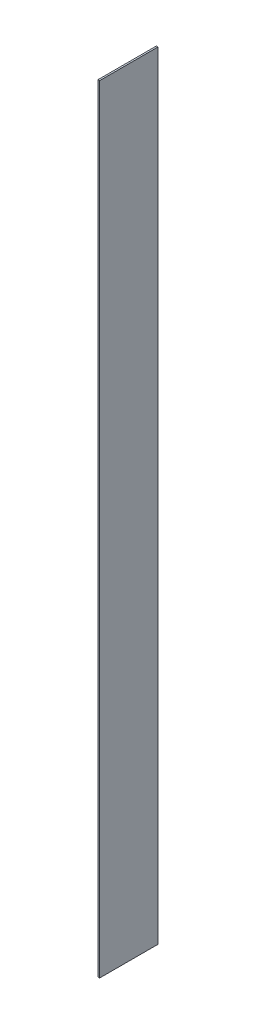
ISO-10303-21;
HEADER;
FILE_DESCRIPTION(('STEP AP214'),'2;1');
FILE_NAME('part.step','',(''),(''),'','','');
FILE_SCHEMA(('AUTOMOTIVE_DESIGN { 1 0 10303 214 1 1 1 1 }'));
ENDSEC;
DATA;
#1=APPLICATION_CONTEXT('core data for automotive mechanical design processes');
#2=APPLICATION_PROTOCOL_DEFINITION('international standard','automotive_design',2000,#1);
#3=PRODUCT_CONTEXT('',#1,'mechanical');
#4=PRODUCT('Part','Part','',(#3));
#5=PRODUCT_RELATED_PRODUCT_CATEGORY('part','',(#4));
#6=PRODUCT_DEFINITION_FORMATION('','',#4);
#7=PRODUCT_DEFINITION_CONTEXT('part definition',#1,'design');
#8=PRODUCT_DEFINITION('design','',#6,#7);
#9=PRODUCT_DEFINITION_SHAPE('','',#8);
#10=(LENGTH_UNIT() NAMED_UNIT(*) SI_UNIT(.MILLI.,.METRE.));
#11=(NAMED_UNIT(*) PLANE_ANGLE_UNIT() SI_UNIT($,.RADIAN.));
#12=(NAMED_UNIT(*) SI_UNIT($,.STERADIAN.) SOLID_ANGLE_UNIT());
#13=UNCERTAINTY_MEASURE_WITH_UNIT(LENGTH_MEASURE(1.E-05),#10,'distance_accuracy_value','');
#14=(GEOMETRIC_REPRESENTATION_CONTEXT(3) GLOBAL_UNCERTAINTY_ASSIGNED_CONTEXT((#13)) GLOBAL_UNIT_ASSIGNED_CONTEXT((#10,
#11,#12)) REPRESENTATION_CONTEXT('',''));
#15=CARTESIAN_POINT('',(0.,0.,0.));
#16=DIRECTION('',(0.,0.,1.));
#17=DIRECTION('',(1.,0.,0.));
#18=AXIS2_PLACEMENT_3D('',#15,#16,#17);
#19=CARTESIAN_POINT('',(-19.0499999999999,8973.4125,673.00625));
#20=DIRECTION('',(1.,0.,0.));
#21=DIRECTION('',(0.,0.,-1.));
#22=AXIS2_PLACEMENT_3D('',#19,#20,#21);
#23=PLANE('',#22);
#24=DIRECTION('',(0.,0.,1.));
#25=VECTOR('',#24,1.);
#26=CARTESIAN_POINT('',(-19.0499999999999,-8973.4125,673.00625));
#27=LINE('',#26,#25);
#28=CARTESIAN_POINT('',(-19.0500000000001,-8973.4125,-673.00625));
#29=VERTEX_POINT('',#28);
#30=CARTESIAN_POINT('',(-19.0499999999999,-8973.4125,673.00625));
#31=VERTEX_POINT('',#30);
#32=EDGE_CURVE('E114',#29,#31,#27,.T.);
#33=ORIENTED_EDGE('',*,*,#32,.T.);
#34=DIRECTION('',(0.,-1.,0.));
#35=VECTOR('',#34,1.);
#36=CARTESIAN_POINT('',(-19.0499999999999,8973.4125,673.00625));
#37=LINE('',#36,#35);
#38=CARTESIAN_POINT('',(-19.0499999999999,8973.4125,673.00625));
#39=VERTEX_POINT('',#38);
#40=EDGE_CURVE('E11',#39,#31,#37,.T.);
#41=ORIENTED_EDGE('',*,*,#40,.F.);
#42=DIRECTION('',(0.,0.,1.));
#43=VECTOR('',#42,1.);
#44=CARTESIAN_POINT('',(-19.0499999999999,8973.4125,673.00625));
#45=LINE('',#44,#43);
#46=CARTESIAN_POINT('',(-19.0500000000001,8973.4125,-673.00625));
#47=VERTEX_POINT('',#46);
#48=EDGE_CURVE('E100',#47,#39,#45,.T.);
#49=ORIENTED_EDGE('',*,*,#48,.F.);
#50=DIRECTION('',(0.,-1.,0.));
#51=VECTOR('',#50,1.);
#52=CARTESIAN_POINT('',(-19.0500000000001,8973.4125,-673.00625));
#53=LINE('',#52,#51);
#54=EDGE_CURVE('E108',#47,#29,#53,.T.);
#55=ORIENTED_EDGE('',*,*,#54,.T.);
#56=EDGE_LOOP('',(#33,#41,#49,#55));
#57=FACE_BOUND('',#56,.T.);
#58=ADVANCED_FACE('F44',(#57),#23,.F.);
#59=CARTESIAN_POINT('',(19.0500000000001,8973.4125,673.00625));
#60=DIRECTION('',(0.,0.,-1.));
#61=DIRECTION('',(-1.,0.,0.));
#62=AXIS2_PLACEMENT_3D('',#59,#60,#61);
#63=PLANE('',#62);
#64=DIRECTION('',(1.,0.,0.));
#65=VECTOR('',#64,1.);
#66=CARTESIAN_POINT('',(19.0500000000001,-8973.4125,673.00625));
#67=LINE('',#66,#65);
#68=CARTESIAN_POINT('',(19.0500000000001,-8973.4125,673.00625));
#69=VERTEX_POINT('',#68);
#70=EDGE_CURVE('E105',#31,#69,#67,.T.);
#71=ORIENTED_EDGE('',*,*,#70,.T.);
#72=DIRECTION('',(0.,-1.,0.));
#73=VECTOR('',#72,1.);
#74=CARTESIAN_POINT('',(19.0500000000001,8973.4125,673.00625));
#75=LINE('',#74,#73);
#76=CARTESIAN_POINT('',(19.0500000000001,8973.4125,673.00625));
#77=VERTEX_POINT('',#76);
#78=EDGE_CURVE('E53',#77,#69,#75,.T.);
#79=ORIENTED_EDGE('',*,*,#78,.F.);
#80=DIRECTION('',(1.,0.,0.));
#81=VECTOR('',#80,1.);
#82=CARTESIAN_POINT('',(19.0500000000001,8973.4125,673.00625));
#83=LINE('',#82,#81);
#84=EDGE_CURVE('E95',#39,#77,#83,.T.);
#85=ORIENTED_EDGE('',*,*,#84,.F.);
#86=ORIENTED_EDGE('',*,*,#40,.T.);
#87=EDGE_LOOP('',(#71,#79,#85,#86));
#88=FACE_BOUND('',#87,.T.);
#89=ADVANCED_FACE('F101',(#88),#63,.F.);
#90=CARTESIAN_POINT('',(19.0500000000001,8973.4125,673.00625));
#91=DIRECTION('',(-1.,0.,0.));
#92=DIRECTION('',(0.,0.,1.));
#93=AXIS2_PLACEMENT_3D('',#90,#91,#92);
#94=PLANE('',#93);
#95=DIRECTION('',(0.,0.,-1.));
#96=VECTOR('',#95,1.);
#97=CARTESIAN_POINT('',(19.0500000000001,-8973.4125,673.00625));
#98=LINE('',#97,#96);
#99=CARTESIAN_POINT('',(19.0499999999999,-8973.4125,-673.00625));
#100=VERTEX_POINT('',#99);
#101=EDGE_CURVE('E79',#69,#100,#98,.T.);
#102=ORIENTED_EDGE('',*,*,#101,.T.);
#103=DIRECTION('',(0.,-1.,0.));
#104=VECTOR('',#103,1.);
#105=CARTESIAN_POINT('',(19.0499999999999,8973.4125,-673.00625));
#106=LINE('',#105,#104);
#107=CARTESIAN_POINT('',(19.0499999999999,8973.4125,-673.00625));
#108=VERTEX_POINT('',#107);
#109=EDGE_CURVE('E102',#108,#100,#106,.T.);
#110=ORIENTED_EDGE('',*,*,#109,.F.);
#111=DIRECTION('',(0.,0.,-1.));
#112=VECTOR('',#111,1.);
#113=CARTESIAN_POINT('',(19.0500000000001,8973.4125,673.00625));
#114=LINE('',#113,#112);
#115=EDGE_CURVE('E92',#77,#108,#114,.T.);
#116=ORIENTED_EDGE('',*,*,#115,.F.);
#117=ORIENTED_EDGE('',*,*,#78,.T.);
#118=EDGE_LOOP('',(#102,#110,#116,#117));
#119=FACE_BOUND('',#118,.T.);
#120=ADVANCED_FACE('F104',(#119),#94,.F.);
#121=CARTESIAN_POINT('',(19.0499999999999,8973.4125,-673.00625));
#122=DIRECTION('',(0.,0.,1.));
#123=DIRECTION('',(1.,0.,0.));
#124=AXIS2_PLACEMENT_3D('',#121,#122,#123);
#125=PLANE('',#124);
#126=DIRECTION('',(-1.,0.,0.));
#127=VECTOR('',#126,1.);
#128=CARTESIAN_POINT('',(19.0499999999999,-8973.4125,-673.00625));
#129=LINE('',#128,#127);
#130=EDGE_CURVE('E81',#100,#29,#129,.T.);
#131=ORIENTED_EDGE('',*,*,#130,.T.);
#132=ORIENTED_EDGE('',*,*,#54,.F.);
#133=DIRECTION('',(-1.,0.,0.));
#134=VECTOR('',#133,1.);
#135=CARTESIAN_POINT('',(19.0499999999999,8973.4125,-673.00625));
#136=LINE('',#135,#134);
#137=EDGE_CURVE('E65',#108,#47,#136,.T.);
#138=ORIENTED_EDGE('',*,*,#137,.F.);
#139=ORIENTED_EDGE('',*,*,#109,.T.);
#140=EDGE_LOOP('',(#131,#132,#138,#139));
#141=FACE_BOUND('',#140,.T.);
#142=ADVANCED_FACE('F127',(#141),#125,.F.);
#143=CARTESIAN_POINT('',(0.,8973.4125,0.));
#144=DIRECTION('',(0.,1.,0.));
#145=DIRECTION('',(0.,0.,1.));
#146=AXIS2_PLACEMENT_3D('',#143,#144,#145);
#147=PLANE('',#146);
#148=ORIENTED_EDGE('',*,*,#48,.T.);
#149=ORIENTED_EDGE('',*,*,#84,.T.);
#150=ORIENTED_EDGE('',*,*,#115,.T.);
#151=ORIENTED_EDGE('',*,*,#137,.T.);
#152=EDGE_LOOP('',(#148,#149,#150,#151));
#153=FACE_BOUND('',#152,.T.);
#154=ADVANCED_FACE('F91',(#153),#147,.T.);
#155=CARTESIAN_POINT('',(0.,-8973.4125,0.));
#156=DIRECTION('',(0.,1.,0.));
#157=DIRECTION('',(0.,0.,1.));
#158=AXIS2_PLACEMENT_3D('',#155,#156,#157);
#159=PLANE('',#158);
#160=ORIENTED_EDGE('',*,*,#32,.F.);
#161=ORIENTED_EDGE('',*,*,#130,.F.);
#162=ORIENTED_EDGE('',*,*,#101,.F.);
#163=ORIENTED_EDGE('',*,*,#70,.F.);
#164=EDGE_LOOP('',(#160,#161,#162,#163));
#165=FACE_BOUND('',#164,.T.);
#166=ADVANCED_FACE('F129',(#165),#159,.F.);
#167=CLOSED_SHELL('',(#58,#89,#120,#142,#154,#166));
#168=MANIFOLD_SOLID_BREP('B2',#167);
#169=ADVANCED_BREP_SHAPE_REPRESENTATION('',(#18,#168),#14);
#170=SHAPE_DEFINITION_REPRESENTATION(#9,#169);
ENDSEC;
END-ISO-10303-21;
